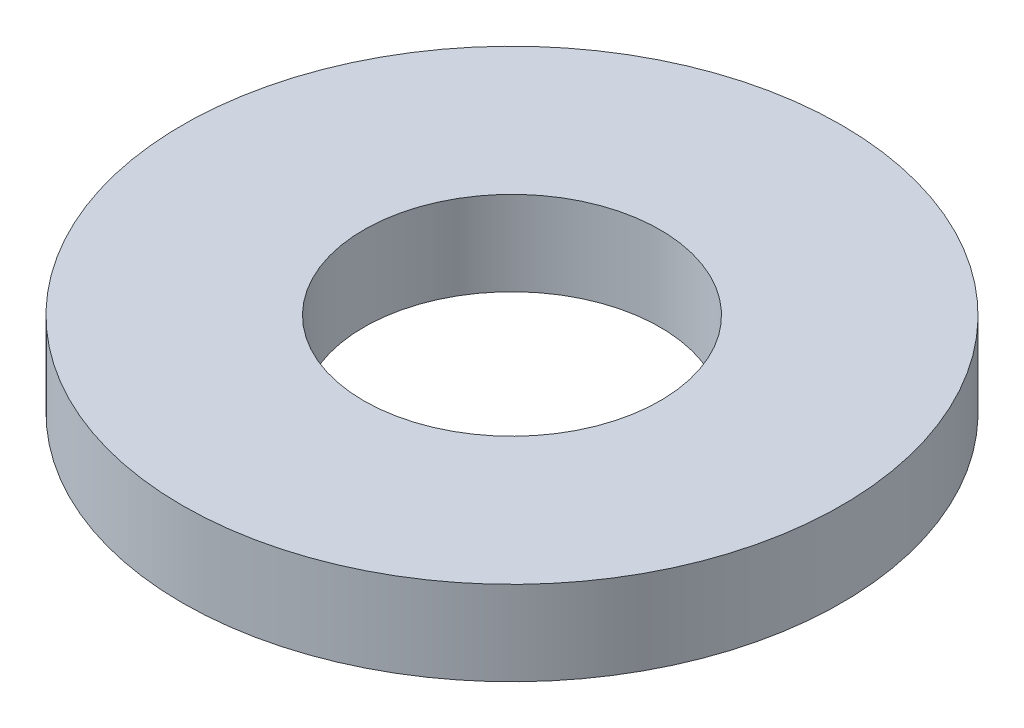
from build123d import *

# Parameters (mm, degrees)
SKETCH1_R           = 7.9375
BOSS_EXTRUDE1_DEPTH = 2.032
SKETCH5_R           = 3.5687
CUT_EXTRUDE1_DEPTH  = 12.40775335


with BuildPart() as part:
    # Sketch1 → Boss-Extrude1 (new body)
    with BuildSketch(Plane(origin=(0, 0, 0), x_dir=(1, 0, 0), z_dir=(0, 1, 0))):
        with Locations(Location((0, 0, 0), (0, 0, 270))):
            Circle(SKETCH1_R)
    extrude(amount=BOSS_EXTRUDE1_DEPTH)

    # Sketch5 → Cut-Extrude1 (cut, through all)
    with BuildSketch(Plane(origin=(0, 2.032, 0), x_dir=(-1, 0, 0), z_dir=(0, 1, 0))):
        with Locations(Location((0, 0, 0), (0, 0, 90))):
            Circle(SKETCH5_R)
    extrude(amount=-CUT_EXTRUDE1_DEPTH, mode=Mode.SUBTRACT)


solid = part.part
